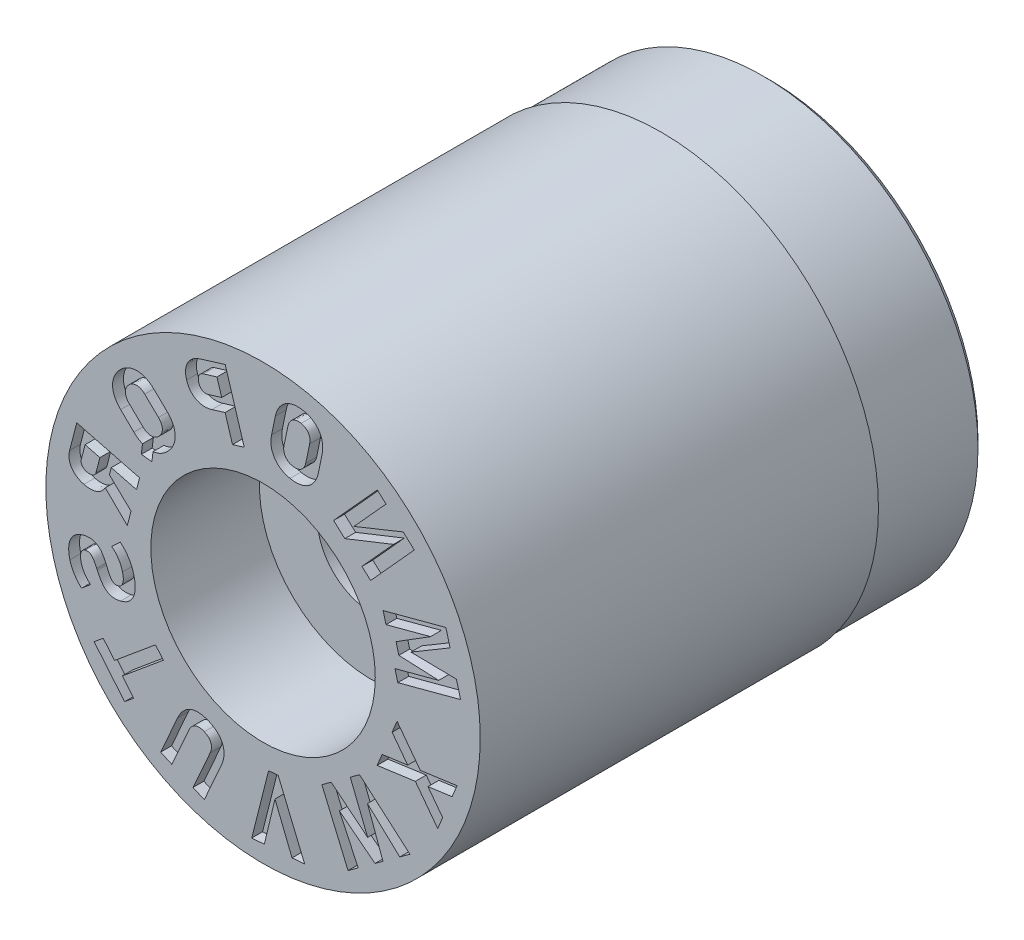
from build123d import *

# Parameters (mm, degrees)
SKETCH4_W          = 3
SKETCH4_H          = 1
CUT_EXTRUDE1_DEPTH = 0.3


with BuildPart() as part:
    # Sketch1 → Revolve1 (revolve)
    with BuildSketch(Plane(origin=(0, 0, 0), x_dir=(0, 0, -1), z_dir=(1, 0, 0)), mode=Mode.PRIVATE) as revolve1_sk:
        Polygon((0, 6), (0, 3.1), (3, 3.1), (3, 1.5), (14, 1.5), (14, 5.75), (13.75, 6), align=None)
    revolve(revolve1_sk.sketch.rotate(Axis((0, 0, 3.797909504), (0, 0, -1)), 90), axis=Axis((0, 0, 3.797909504), (0, 0, -1)))

    # Sketch4 → Cut-Revolve1 (revolve, cut)
    with BuildSketch(Plane(origin=(0, 0, 0), x_dir=(0, 0, -1), z_dir=(1, 0, 0)), mode=Mode.PRIVATE) as cut_revolve1_sk:
        with Locations((12.5, 6.435)):
            Rectangle(SKETCH4_W, SKETCH4_H)
    revolve(cut_revolve1_sk.sketch.rotate(Axis((0, 0, 0), (0, 0, -1)), 90), axis=Axis((0, 0, 0), (0, 0, -1)), mode=Mode.SUBTRACT)

    # Sketch5 → Cut-Extrude1 (cut)
    # profile 1 of 12: a face of its own
    with BuildSketch(Plane.XY):
        Polygon((5.165432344, 1.744404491), (5.050616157, 2.174785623), (3.316452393, 1.712478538), (3.395817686, 1.41575396), (4.627323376, 1.744008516), (3.674151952, 1.147631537), (3.751081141, 0.858816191), (4.851491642, 0.809771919), (3.643040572, 0.487662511), (3.722087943, 0.190754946), (5.456251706, 0.653062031), (5.341753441, 1.083626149), (4.084829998, 1.102548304), align=None)
    # profile 2 of 12: a face of its own
    with BuildSketch(Plane.XY):
        with BuildLine():
            Line((-1.044555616, 5.41745806), (-1.368184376, 5.318713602))
            Line((-1.368184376, 5.318713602), (-1.733205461, 5.207305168))
            add(Edge.make_bspline(
                [(-1.733205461, 5.207305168), (-1.784002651, 5.192190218), (-1.856286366, 5.161722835), (-1.941617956, 5.105150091), (-1.99654212, 5.057090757), (-2.043649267, 5.003344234), (-2.081646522, 4.944277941), (-2.111088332, 4.880652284), (-2.13062999, 4.812701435), (-2.141422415, 4.741543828), (-2.142364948, 4.641165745), (-2.1268093, 4.565880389), (-2.112011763, 4.516342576)],
                knots=[0, 0, 0, 0, 0.179249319, 0.263207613, 0.345336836, 0.425393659, 0.504137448, 0.582089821, 0.661679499, 0.74247115, 0.824840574, 1, 1, 1, 1], degree=3))
            add(Edge.make_bspline(
                [(-2.112011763, 4.516342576), (-2.09694524, 4.466650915), (-2.066944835, 4.395785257), (-2.010203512, 4.312864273), (-1.96154023, 4.259985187), (-1.907399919, 4.21470733), (-1.847665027, 4.178589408), (-1.783117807, 4.151307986), (-1.714213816, 4.133340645), (-1.641861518, 4.124270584), (-1.539595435, 4.125316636), (-1.462748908, 4.140924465), (-1.412087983, 4.156402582)],
                knots=[0, 0, 0, 0, 0.175848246, 0.258224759, 0.339010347, 0.418385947, 0.496356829, 0.574427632, 0.654798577, 0.736649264, 0.820571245, 1, 1, 1, 1], degree=3))
            Line((-1.412087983, 4.156402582), (-1.047206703, 4.267768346))
            Line((-1.047206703, 4.267768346), (-0.843867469, 3.601994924))
            Line((-0.843867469, 3.601994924), (-0.520214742, 3.700660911))
            Line((-0.520214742, 3.700660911), (-1.044555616, 5.41745806))
        make_face()
        with BuildLine():
            Line((-1.142425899, 4.579535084), (-1.515667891, 4.465685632))
            add(Edge.make_bspline(
                [(-1.515667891, 4.465685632), (-1.53399933, 4.460377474), (-1.561893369, 4.45454321), (-1.599188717, 4.455670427), (-1.625855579, 4.460351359), (-1.651442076, 4.468646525), (-1.67525097, 4.480999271), (-1.697618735, 4.496163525), (-1.718161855, 4.514939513), (-1.736775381, 4.536705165), (-1.758926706, 4.5702991), (-1.769899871, 4.599081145), (-1.776270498, 4.618731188)],
                knots=[0, 0, 0, 0, 0.169095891, 0.248836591, 0.328291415, 0.407591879, 0.485444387, 0.564479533, 0.645699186, 0.730517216, 0.816943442, 1, 1, 1, 1], degree=3))
            add(Edge.make_bspline(
                [(-1.776270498, 4.618731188), (-1.782139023, 4.638805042), (-1.78905274, 4.66916884), (-1.789735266, 4.709709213), (-1.786773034, 4.738309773), (-1.780946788, 4.765550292), (-1.771042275, 4.790895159), (-1.758210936, 4.814470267), (-1.741317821, 4.835295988), (-1.72209954, 4.854328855), (-1.691304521, 4.876095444), (-1.664676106, 4.887225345), (-1.646184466, 4.893056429)],
                knots=[0, 0, 0, 0, 0.184004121, 0.270929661, 0.354752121, 0.43598557, 0.514588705, 0.592824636, 0.670550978, 0.749073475, 0.829594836, 1, 1, 1, 1], degree=3))
            Line((-1.646184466, 4.893056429), (-1.272951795, 5.006903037))
            Line((-1.272951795, 5.006903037), (-1.142425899, 4.579535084))
        make_face(mode=Mode.SUBTRACT)
    # profile 3 of 12: a face of its own
    with BuildSketch(Plane.XY):
        Polygon((4.178673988, 3.59236831), (3.871348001, 3.870865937), (2.512445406, 3.323196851), (3.396866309, 4.30017916), (3.156380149, 4.517832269), (1.949458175, 3.184602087), (2.258753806, 2.904824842), (3.602273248, 3.438584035), (2.731630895, 2.476827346), (2.971752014, 2.259138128), align=None)
    # profile 4 of 12: a face of its own
    with BuildSketch(Plane.XY):
        with BuildLine():
            Line((1.526209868, 4.105294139), (1.630966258, 4.605963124))
            add(Edge.make_bspline(
                [(1.630966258, 4.605963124), (1.637182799, 4.637462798), (1.645233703, 4.684487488), (1.649233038, 4.747184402), (1.649472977, 4.79260781), (1.647390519, 4.837170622), (1.641854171, 4.880599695), (1.634055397, 4.923267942), (1.622940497, 4.964748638), (1.609423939, 5.005046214), (1.593466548, 5.043856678), (1.574772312, 5.080966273), (1.55332772, 5.116170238), (1.529887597, 5.149989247), (1.503507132, 5.181817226), (1.475044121, 5.212435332), (1.443687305, 5.240774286), (1.410394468, 5.267372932), (1.375095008, 5.292096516), (1.337634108, 5.31445034), (1.298184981, 5.334354), (1.257031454, 5.352450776), (1.19863319, 5.373558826), (1.152929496, 5.385429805), (1.121762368, 5.39182062)],
                knots=[0, 0, 0, 0, 0.091336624, 0.135318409, 0.178449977, 0.220421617, 0.262031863, 0.302813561, 0.343636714, 0.383994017, 0.423572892, 0.462826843, 0.501982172, 0.540671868, 0.579691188, 0.619399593, 0.65941112, 0.699714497, 0.740479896, 0.78182652, 0.82360918, 0.866016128, 0.909554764, 1, 1, 1, 1], degree=3))
            add(Edge.make_bspline(
                [(1.121762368, 5.39182062), (1.090707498, 5.398710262), (1.044133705, 5.405327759), (0.982218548, 5.409781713), (0.937378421, 5.409828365), (0.893285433, 5.407312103), (0.850200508, 5.401835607), (0.807897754, 5.393348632), (0.766667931, 5.382188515), (0.726594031, 5.368548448), (0.688163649, 5.352080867), (0.651445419, 5.333071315), (0.615863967, 5.312270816), (0.58265524, 5.287686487), (0.550545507, 5.261350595), (0.520166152, 5.232357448), (0.491752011, 5.200841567), (0.464907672, 5.167301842), (0.440550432, 5.131341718), (0.418020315, 5.093749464), (0.397866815, 5.054005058), (0.380044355, 5.012314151), (0.359254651, 4.953034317), (0.346728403, 4.907022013), (0.340381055, 4.875455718)],
                knots=[0, 0, 0, 0, 0.090357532, 0.133573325, 0.17639157, 0.217748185, 0.259065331, 0.299763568, 0.340320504, 0.380426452, 0.420022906, 0.459061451, 0.497938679, 0.537051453, 0.576386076, 0.615964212, 0.656310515, 0.696955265, 0.738000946, 0.77969807, 0.821486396, 0.864595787, 0.908510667, 1, 1, 1, 1], degree=3))
            Line((0.340381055, 4.875455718), (0.235624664, 4.374786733))
            add(Edge.make_bspline(
                [(0.235624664, 4.374786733), (0.229424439, 4.34328828), (0.221326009, 4.296260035), (0.217402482, 4.23356879), (0.216955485, 4.188074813), (0.219790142, 4.143574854), (0.224503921, 4.099984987), (0.232996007, 4.057424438), (0.243971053, 4.015857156), (0.25739951, 3.975603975), (0.273705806, 3.93702713), (0.292323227, 3.900109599), (0.313371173, 3.864639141), (0.337350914, 3.831141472), (0.363125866, 3.798664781), (0.392299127, 3.768645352), (0.423089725, 3.739730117), (0.456565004, 3.713263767), (0.491822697, 3.688496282), (0.529192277, 3.666221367), (0.568623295, 3.646285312), (0.609668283, 3.628241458), (0.668054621, 3.607158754), (0.713639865, 3.595420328), (0.744681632, 3.588593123)],
                knots=[0, 0, 0, 0, 0.09136596, 0.135361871, 0.178507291, 0.220649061, 0.262096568, 0.303087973, 0.343924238, 0.384294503, 0.423645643, 0.4629122, 0.501796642, 0.540795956, 0.579987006, 0.619572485, 0.65970998, 0.700026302, 0.740804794, 0.782164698, 0.823613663, 0.866381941, 0.909587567, 1, 1, 1, 1], degree=3))
            add(Edge.make_bspline(
                [(0.744681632, 3.588593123), (0.775861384, 3.582580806), (0.822435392, 3.574739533), (0.884450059, 3.570865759), (0.929427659, 3.571013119), (0.973537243, 3.573213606), (1.016725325, 3.578784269), (1.059030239, 3.587248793), (1.10025649, 3.598419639), (1.140342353, 3.612039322), (1.178729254, 3.62857651), (1.215633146, 3.647345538), (1.25060991, 3.669085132), (1.284439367, 3.69274841), (1.31634557, 3.719304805), (1.346768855, 3.748232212), (1.375180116, 3.77976069), (1.40199059, 3.813317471), (1.426480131, 3.849183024), (1.448527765, 3.887184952), (1.468793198, 3.92684404), (1.486582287, 3.968554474), (1.507339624, 4.027713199), (1.519860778, 4.07372906), (1.526209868, 4.105294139)],
                knots=[0, 0, 0, 0, 0.090308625, 0.133954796, 0.176439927, 0.218092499, 0.259395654, 0.300080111, 0.340623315, 0.380715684, 0.42029873, 0.459324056, 0.498271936, 0.537250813, 0.576572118, 0.616136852, 0.656469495, 0.697100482, 0.738132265, 0.779773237, 0.821894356, 0.864641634, 0.908541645, 1, 1, 1, 1], degree=3))
        make_face()
        with BuildLine():
            Line((0.579153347, 4.294282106), (0.687307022, 4.811881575))
            add(Edge.make_bspline(
                [(0.687307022, 4.811881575), (0.69403254, 4.840761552), (0.705780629, 4.883493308), (0.733761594, 4.933814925), (0.757305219, 4.967357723), (0.784946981, 4.996348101), (0.815600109, 5.020741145), (0.849441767, 5.04029762), (0.886191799, 5.054475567), (0.925236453, 5.064022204), (0.981129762, 5.069159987), (1.02384609, 5.064769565), (1.052218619, 5.058713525)],
                knots=[0, 0, 0, 0, 0.179938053, 0.264468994, 0.346756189, 0.426903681, 0.505549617, 0.582668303, 0.662059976, 0.742723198, 0.824728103, 1, 1, 1, 1], degree=3))
            add(Edge.make_bspline(
                [(1.052218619, 5.058713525), (1.080665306, 5.052940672), (1.121789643, 5.040110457), (1.170915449, 5.012755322), (1.202735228, 4.988314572), (1.230537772, 4.96056308), (1.25387289, 4.929371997), (1.272060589, 4.894600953), (1.285759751, 4.856925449), (1.294037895, 4.816758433), (1.298892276, 4.75938674), (1.293748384, 4.715526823), (1.287773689, 4.686320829)],
                knots=[0, 0, 0, 0, 0.175431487, 0.25780614, 0.338407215, 0.416986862, 0.49438821, 0.572700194, 0.653145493, 0.735731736, 0.819660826, 1, 1, 1, 1], degree=3))
            Line((1.287773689, 4.686320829), (1.179620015, 4.168721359))
            add(Edge.make_bspline(
                [(1.179620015, 4.168721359), (1.173426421, 4.139615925), (1.160347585, 4.097490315), (1.133301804, 4.04670384), (1.109571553, 4.013282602), (1.082116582, 3.984259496), (1.051230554, 3.960180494), (1.017668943, 3.940384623), (0.981009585, 3.925903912), (0.941921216, 3.916364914), (0.885855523, 3.911634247), (0.843018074, 3.915578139), (0.814561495, 3.921553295)],
                knots=[0, 0, 0, 0, 0.179868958, 0.264322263, 0.346593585, 0.426725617, 0.504705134, 0.582404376, 0.661260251, 0.741907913, 0.824543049, 1, 1, 1, 1], degree=3))
            add(Edge.make_bspline(
                [(0.814561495, 3.921553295), (0.786273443, 3.927757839), (0.745149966, 3.940332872), (0.696371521, 3.967885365), (0.664105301, 3.99176833), (0.636562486, 4.019995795), (0.613033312, 4.051208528), (0.594872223, 4.086008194), (0.581165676, 4.123675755), (0.572889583, 4.163844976), (0.568034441, 4.221215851), (0.573178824, 4.265076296), (0.579153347, 4.294282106)],
                knots=[0, 0, 0, 0, 0.175336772, 0.25698086, 0.337413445, 0.416956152, 0.494361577, 0.572677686, 0.653127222, 0.735717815, 0.819651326, 1, 1, 1, 1], degree=3))
        make_face(mode=Mode.SUBTRACT)
    # profile 5 of 12: a face of its own
    with BuildSketch(Plane.XY):
        with BuildLine():
            Line((-4.192520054, 1.377942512), (-3.49497097, 1.197041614))
            Line((-3.49497097, 1.197041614), (-3.410465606, 1.524131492))
            Line((-3.410465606, 1.524131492), (-5.14567057, 1.974135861))
            Line((-5.14567057, 1.974135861), (-5.34241688, 1.214464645))
            add(Edge.make_bspline(
                [(-5.34241688, 1.214464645), (-5.354279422, 1.169291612), (-5.364170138, 1.100723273), (-5.358865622, 1.010161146), (-5.345209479, 0.946246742), (-5.322875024, 0.885568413), (-5.292042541, 0.828941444), (-5.252998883, 0.776721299), (-5.205737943, 0.729546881), (-5.151370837, 0.687362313), (-5.067156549, 0.638628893), (-4.997115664, 0.612771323), (-4.948000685, 0.600624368)],
                knots=[0, 0, 0, 0, 0.170567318, 0.250705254, 0.330137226, 0.408355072, 0.486026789, 0.564778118, 0.645617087, 0.729164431, 0.815361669, 1, 1, 1, 1], degree=3))
            add(Edge.make_bspline(
                [(-4.948000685, 0.600624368), (-4.899271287, 0.588029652), (-4.825746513, 0.575325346), (-4.72870142, 0.57779281), (-4.660613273, 0.587714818), (-4.596406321, 0.606073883), (-4.536786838, 0.632778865), (-4.482189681, 0.667531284), (-4.433328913, 0.710305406), (-4.390987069, 0.75852104), (-4.367764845, 0.794143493), (-4.357609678, 0.812124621)],
                knots=[0, 0, 0, 0, 0.184091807, 0.27017674, 0.353602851, 0.434756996, 0.513264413, 0.591388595, 0.670212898, 0.749653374, 0.825010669, 0.825010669, 0.825010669, 0.825010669], degree=3))
            Line((-4.357609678, 0.812124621), (-3.75045196, 0.212247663))
            Line((-3.75045196, 0.212247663), (-3.647743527, 0.608145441))
            Line((-3.647743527, 0.608145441), (-4.243895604, 1.17986317))
            Line((-4.243895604, 1.17986317), (-4.192520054, 1.377942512))
        make_face()
        with BuildLine():
            Line((-4.507443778, 1.459614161), (-4.613012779, 1.053072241))
            add(Edge.make_bspline(
                [(-4.613012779, 1.053072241), (-4.617355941, 1.037444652), (-4.625541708, 1.014250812), (-4.644304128, 0.988255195), (-4.660559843, 0.971316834), (-4.679099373, 0.956785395), (-4.700055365, 0.945300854), (-4.722945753, 0.936184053), (-4.747946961, 0.930702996), (-4.774500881, 0.927790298), (-4.812565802, 0.92766733), (-4.841424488, 0.932779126), (-4.860773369, 0.937116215)],
                knots=[0, 0, 0, 0, 0.159482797, 0.236468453, 0.311877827, 0.388500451, 0.4658197, 0.544821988, 0.628636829, 0.715237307, 0.805713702, 1, 1, 1, 1], degree=3))
            add(Edge.make_bspline(
                [(-4.860773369, 0.937116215), (-4.880151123, 0.941690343), (-4.90753206, 0.951688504), (-4.941149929, 0.969405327), (-4.96264354, 0.98506171), (-4.982078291, 1.001699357), (-4.99759072, 1.020746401), (-5.01047161, 1.040959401), (-5.019396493, 1.062835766), (-5.025616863, 1.085644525), (-5.028061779, 1.118138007), (-5.025496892, 1.14284402), (-5.020912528, 1.159112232)],
                knots=[0, 0, 0, 0, 0.193389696, 0.282661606, 0.368882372, 0.451760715, 0.530887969, 0.607069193, 0.684211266, 0.759972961, 0.836228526, 1, 1, 1, 1], degree=3))
            Line((-5.020912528, 1.159112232), (-4.915405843, 1.565414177))
            Line((-4.915405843, 1.565414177), (-4.507443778, 1.459614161))
        make_face(mode=Mode.SUBTRACT)
    # profile 6 of 12: a face of its own
    with BuildSketch(Plane.XY):
        Polygon((-4.102731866, -3.191688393), (-4.415680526, -2.815288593), (-4.666510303, -3.023736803), (-3.823806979, -4.037300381), (-3.572977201, -3.828852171), (-3.886058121, -3.452293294), (-2.754439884, -2.511320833), (-2.971144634, -2.250741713), align=None)
    # profile 7 of 12: a face of its own
    with BuildSketch(Plane.XY):
        with BuildLine():
            Line((-3.329749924, 2.379707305), (-3.362491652, 2.110075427))
            Line((-3.362491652, 2.110075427), (-3.070416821, 2.079452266))
            Line((-3.070416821, 2.079452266), (-3.039359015, 2.336379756))
            add(Edge.make_bspline(
                [(-3.039359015, 2.336379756), (-3.030067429, 2.337375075), (-3.007028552, 2.34051761), (-2.970399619, 2.348247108), (-2.929378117, 2.358970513), (-2.888829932, 2.372733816), (-2.849135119, 2.389715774), (-2.8101777, 2.409171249), (-2.772363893, 2.432131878), (-2.734787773, 2.456910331), (-2.686261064, 2.495805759), (-2.651036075, 2.52717523), (-2.629188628, 2.550395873)],
                knots=[0.553403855, 0.553403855, 0.553403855, 0.553403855, 0.579915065, 0.619336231, 0.659573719, 0.70019099, 0.740726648, 0.782026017, 0.823652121, 0.866210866, 0.909660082, 1, 1, 1, 1], degree=3))
            add(Edge.make_bspline(
                [(-2.629188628, 2.550395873), (-2.606992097, 2.573257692), (-2.576220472, 2.608989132), (-2.539333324, 2.658924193), (-2.515183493, 2.696874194), (-2.494197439, 2.735855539), (-2.475546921, 2.775342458), (-2.459989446, 2.815607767), (-2.44732303, 2.856491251), (-2.43787414, 2.897690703), (-2.43084764, 2.938943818), (-2.427777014, 2.980203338), (-2.42663541, 3.021541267), (-2.429283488, 3.062805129), (-2.434715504, 3.104068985), (-2.443082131, 3.145239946), (-2.45436016, 3.186315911), (-2.468544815, 3.226940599), (-2.485712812, 3.266832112), (-2.505800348, 3.305878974), (-2.528777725, 3.344104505), (-2.554735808, 3.381344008), (-2.593202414, 3.431013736), (-2.625978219, 3.465764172), (-2.649116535, 3.488219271)],
                knots=[0, 0, 0, 0, 0.090426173, 0.133688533, 0.176148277, 0.218000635, 0.259295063, 0.300043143, 0.340440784, 0.380689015, 0.419969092, 0.459107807, 0.498041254, 0.537279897, 0.576344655, 0.616120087, 0.656449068, 0.697180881, 0.73817807, 0.779637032, 0.821747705, 0.86469138, 0.908434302, 1, 1, 1, 1], degree=3))
            Line((-2.649116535, 3.488219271), (-3.016657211, 3.844445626))
            add(Edge.make_bspline(
                [(-3.016657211, 3.844445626), (-3.039455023, 3.867227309), (-3.075872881, 3.898186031), (-3.126748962, 3.935209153), (-3.164838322, 3.96018276), (-3.204024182, 3.981559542), (-3.243514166, 4.000576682), (-3.283884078, 4.016598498), (-3.324954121, 4.029442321), (-3.366369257, 4.039459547), (-3.407806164, 4.046509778), (-3.44926284, 4.050860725), (-3.490641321, 4.05135965), (-3.531931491, 4.04993415), (-3.573077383, 4.044647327), (-3.614155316, 4.036768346), (-3.654980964, 4.025778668), (-3.69543798, 4.012012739), (-3.734983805, 3.994833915), (-3.773939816, 3.975066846), (-3.811889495, 3.952537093), (-3.849230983, 3.927394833), (-3.897761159, 3.888693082), (-3.932933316, 3.857242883), (-3.954798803, 3.834049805)],
                knots=[0, 0, 0, 0, 0.091402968, 0.135416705, 0.178547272, 0.22056748, 0.262011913, 0.302888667, 0.343719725, 0.384050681, 0.423731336, 0.462947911, 0.502219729, 0.541090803, 0.580114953, 0.619825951, 0.659729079, 0.700018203, 0.741006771, 0.781995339, 0.823929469, 0.866198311, 0.909651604, 1, 1, 1, 1], degree=3))
            add(Edge.make_bspline(
                [(-3.954798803, 3.834049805), (-3.977024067, 3.811205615), (-4.007711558, 3.775422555), (-4.044793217, 3.725488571), (-4.068563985, 3.68731025), (-4.089911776, 3.648538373), (-4.108422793, 3.609092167), (-4.123993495, 3.568839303), (-4.136699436, 3.527959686), (-4.145984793, 3.486709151), (-4.153634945, 3.445534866), (-4.156542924, 3.404104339), (-4.157761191, 3.362764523), (-4.154890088, 3.321541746), (-4.150262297, 3.280276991), (-4.1411078, 3.239245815), (-4.130041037, 3.19810817), (-4.115792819, 3.157497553), (-4.098659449, 3.117591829), (-4.07844728, 3.078493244), (-4.055680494, 3.040017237), (-4.029590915, 3.002731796), (-3.991150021, 2.95304676), (-3.958358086, 2.918305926), (-3.935225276, 2.895847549)],
                knots=[0, 0, 0, 0, 0.090391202, 0.133636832, 0.176367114, 0.217904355, 0.259182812, 0.299915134, 0.340297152, 0.380529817, 0.419863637, 0.458987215, 0.498252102, 0.537128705, 0.576145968, 0.615965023, 0.656278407, 0.696994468, 0.737975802, 0.779418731, 0.821816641, 0.864743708, 0.908469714, 1, 1, 1, 1], degree=3))
            Line((-3.935225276, 2.895847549), (-3.5676846, 2.539621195))
            add(Edge.make_bspline(
                [(-3.5676846, 2.539621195), (-3.544869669, 2.516865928), (-3.508501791, 2.48583008), (-3.457627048, 2.448988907), (-3.419754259, 2.423672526), (-3.380470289, 2.402545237), (-3.35028581, 2.388392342), (-3.333327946, 2.381191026), (-3.329749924, 2.379707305)],
                knots=[0, 0, 0, 0, 0.091394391, 0.135403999, 0.178246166, 0.220560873, 0.261842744, 0.272833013, 0.272833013, 0.272833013, 0.272833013], degree=3))
        make_face()
        with BuildLine():
            Line((-3.315376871, 2.78771233), (-3.695798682, 3.155987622))
            add(Edge.make_bspline(
                [(-3.695798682, 3.155987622), (-3.717082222, 3.176996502), (-3.745861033, 3.210532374), (-3.774603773, 3.260592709), (-3.789637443, 3.298734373), (-3.800049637, 3.337285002), (-3.804331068, 3.376250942), (-3.802673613, 3.415297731), (-3.794918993, 3.454000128), (-3.782362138, 3.492284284), (-3.756531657, 3.542265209), (-3.729908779, 3.576094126), (-3.709788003, 3.597054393)],
                knots=[0, 0, 0, 0, 0.180529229, 0.264652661, 0.347008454, 0.427165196, 0.50483005, 0.582494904, 0.661932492, 0.74221129, 0.824735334, 1, 1, 1, 1], degree=3))
            add(Edge.make_bspline(
                [(-3.709788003, 3.597054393), (-3.689924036, 3.618298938), (-3.656560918, 3.645212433), (-3.607514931, 3.672585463), (-3.569815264, 3.686493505), (-3.531367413, 3.695413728), (-3.492361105, 3.698033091), (-3.453182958, 3.69540876), (-3.414123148, 3.686587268), (-3.375750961, 3.672247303), (-3.324416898, 3.645929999), (-3.290191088, 3.617700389), (-3.268622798, 3.597099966)],
                knots=[0, 0, 0, 0, 0.175091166, 0.256927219, 0.337893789, 0.416762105, 0.494293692, 0.572926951, 0.652922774, 0.734997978, 0.819565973, 1, 1, 1, 1], degree=3))
            Line((-3.268622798, 3.597099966), (-2.888200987, 3.228824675))
            add(Edge.make_bspline(
                [(-2.888200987, 3.228824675), (-2.86677548, 3.208083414), (-2.838084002, 3.174564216), (-2.809449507, 3.124577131), (-2.794183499, 3.086396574), (-2.784453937, 3.047452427), (-2.779960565, 3.00830772), (-2.781807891, 2.969182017), (-2.788952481, 2.930402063), (-2.801627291, 2.892144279), (-2.827598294, 2.84236607), (-2.853086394, 2.807817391), (-2.873832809, 2.787403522)],
                knots=[0, 0, 0, 0, 0.179935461, 0.26404173, 0.34638072, 0.42708227, 0.505466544, 0.583115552, 0.662375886, 0.742638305, 0.825145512, 1, 1, 1, 1], degree=3))
            add(Edge.make_bspline(
                [(-2.873832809, 2.787403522), (-2.893964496, 2.766282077), (-2.92704716, 2.738667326), (-2.976581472, 2.711948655), (-3.01415773, 2.697913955), (-3.052741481, 2.689051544), (-3.091770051, 2.686262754), (-3.130922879, 2.689546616), (-3.169948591, 2.69830379), (-3.208578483, 2.712280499), (-3.25927318, 2.739775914), (-3.294100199, 2.766751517), (-3.315376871, 2.78771233)],
                knots=[0, 0, 0, 0, 0.175985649, 0.257432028, 0.338339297, 0.417149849, 0.495361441, 0.573284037, 0.65322127, 0.735919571, 0.820148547, 1, 1, 1, 1], degree=3))
        make_face(mode=Mode.SUBTRACT)
    # profile 8 of 12: a face of its own
    with BuildSketch(Plane.XY):
        with BuildLine():
            Line((-3.947487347, -0.281314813), (-4.181714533, -0.50182307))
            add(Edge.make_bspline(
                [(-4.181714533, -0.50182307), (-4.145326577, -0.528699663), (-4.094671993, -0.574981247), (-4.035154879, -0.645290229), (-3.994647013, -0.703303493), (-3.958205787, -0.764618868), (-3.916365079, -0.850303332), (-3.894043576, -0.918387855), (-3.882133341, -0.964465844)],
                knots=[0, 0, 0, 0, 0.241379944, 0.364999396, 0.491374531, 0.618868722, 0.74565667, 1, 1, 1, 1], degree=3))
            add(Edge.make_bspline(
                [(-3.882133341, -0.964465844), (-3.875957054, -0.989866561), (-3.867918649, -1.027175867), (-3.862084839, -1.076306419), (-3.859366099, -1.110160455), (-3.860158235, -1.142363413), (-3.862406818, -1.172684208), (-3.867346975, -1.201239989), (-3.874314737, -1.227793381), (-3.883346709, -1.252417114), (-3.8946896, -1.274640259), (-3.90817686, -1.294460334), (-3.9235832, -1.312071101), (-3.941480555, -1.326931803), (-3.968656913, -1.343523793), (-3.991296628, -1.352059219), (-4.007049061, -1.35618213)],
                knots=[0, 0, 0, 0, 0.170586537, 0.248328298, 0.322568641, 0.391806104, 0.458159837, 0.52068033, 0.580487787, 0.636971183, 0.691384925, 0.742745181, 0.792953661, 0.843465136, 0.893800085, 1, 1, 1, 1], degree=3))
            Line((-4.007049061, -1.35618213), (-4.008516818, -1.356547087))
            add(Edge.make_bspline(
                [(-4.008516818, -1.356547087), (-4.029590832, -1.362214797), (-4.061585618, -1.365039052), (-4.102537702, -1.357268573), (-4.129434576, -1.344869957), (-4.153831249, -1.327798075), (-4.176396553, -1.307230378), (-4.197091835, -1.283074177), (-4.216064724, -1.255125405), (-4.233583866, -1.222645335), (-4.259761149, -1.171410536), (-4.278215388, -1.129857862), (-4.290774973, -1.100728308)],
                knots=[0, 0, 0, 0, 0.155113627, 0.225021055, 0.294520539, 0.364237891, 0.436402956, 0.511396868, 0.590249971, 0.67647546, 0.774019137, 1, 1, 1, 1], degree=3))
            add(Edge.make_bspline(
                [(-4.290774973, -1.100728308), (-4.291664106, -1.098566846), (-4.293447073, -1.094259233), (-4.295029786, -1.08985763), (-4.296347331, -1.087903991)],
                knots=[0, 0, 0, 0, 0.500653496, 1, 1, 1, 1], degree=3))
            Line((-4.296347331, -1.087903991), (-4.306499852, -1.062558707))
            add(Edge.make_bspline(
                [(-4.306499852, -1.062558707), (-4.328281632, -1.01073179), (-4.362369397, -0.937423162), (-4.41123024, -0.846725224), (-4.446815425, -0.789187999), (-4.485438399, -0.738010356), (-4.531455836, -0.694645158), (-4.584114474, -0.657541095), (-4.632890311, -0.632134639), (-4.675353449, -0.615991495), (-4.709852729, -0.607347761), (-4.74625372, -0.601206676), (-4.784794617, -0.598944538), (-4.825377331, -0.59961466), (-4.883897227, -0.605398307), (-4.928471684, -0.613897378), (-4.958517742, -0.621542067)],
                knots=[0, 0, 0, 0, 0.19047014, 0.273752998, 0.348938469, 0.419574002, 0.490324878, 0.562217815, 0.63726617, 0.67600916, 0.715891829, 0.757573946, 0.800921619, 0.846504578, 0.89498026, 1, 1, 1, 1], degree=3))
            Line((-4.958517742, -0.621542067), (-4.959985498, -0.621907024))
            add(Edge.make_bspline(
                [(-4.959985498, -0.621907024), (-4.987330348, -0.628528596), (-5.026950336, -0.641180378), (-5.077225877, -0.662217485), (-5.11232539, -0.679477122), (-5.145260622, -0.699054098), (-5.176003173, -0.720858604), (-5.204706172, -0.744434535), (-5.231343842, -0.769730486), (-5.255444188, -0.797196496), (-5.277245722, -0.82641676), (-5.297507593, -0.856764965), (-5.314231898, -0.889537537), (-5.329453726, -0.923535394), (-5.341914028, -0.959541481), (-5.352359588, -0.997036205), (-5.36024953, -1.036232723), (-5.365398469, -1.076968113), (-5.369038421, -1.119088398), (-5.369385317, -1.162742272), (-5.367403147, -1.207764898), (-5.363077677, -1.254146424), (-5.354076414, -1.318973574), (-5.343704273, -1.367857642), (-5.335631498, -1.400777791)],
                knots=[0, 0, 0, 0, 0.086007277, 0.126939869, 0.166595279, 0.205531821, 0.243984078, 0.281753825, 0.319046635, 0.356206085, 0.393346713, 0.430504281, 0.467637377, 0.50571687, 0.544355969, 0.584034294, 0.624685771, 0.666505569, 0.709556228, 0.753906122, 0.799904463, 0.847339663, 0.896318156, 1, 1, 1, 1], degree=3))
            add(Edge.make_bspline(
                [(-5.335631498, -1.400777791), (-5.327223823, -1.432396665), (-5.313231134, -1.479965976), (-5.287788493, -1.541426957), (-5.259501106, -1.60368366), (-5.21634247, -1.678819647), (-5.137342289, -1.794071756), (-5.064920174, -1.870907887), (-5.012383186, -1.917308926)],
                knots=[0, 0, 0, 0, 0.158911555, 0.240043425, 0.322665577, 0.490655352, 0.659731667, 1, 1, 1, 1], degree=3))
            Line((-5.012383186, -1.917308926), (-4.768028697, -1.708034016))
            add(Edge.make_bspline(
                [(-4.768028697, -1.708034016), (-4.798937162, -1.680456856), (-4.843163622, -1.637094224), (-4.894692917, -1.573408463), (-4.929503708, -1.52449233), (-4.959957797, -1.474580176), (-4.992979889, -1.408300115), (-5.011365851, -1.356926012), (-5.020063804, -1.322311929)],
                knots=[0, 0, 0, 0, 0.265982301, 0.396333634, 0.525300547, 0.651054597, 0.771158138, 1, 1, 1, 1], degree=3))
            add(Edge.make_bspline(
                [(-5.020063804, -1.322311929), (-5.025992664, -1.298442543), (-5.03362969, -1.263295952), (-5.039038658, -1.2170519), (-5.041945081, -1.185195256), (-5.041382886, -1.154974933), (-5.039729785, -1.126669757), (-5.035786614, -1.100015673), (-5.029602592, -1.075287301), (-5.021363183, -1.052415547), (-5.011008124, -1.031930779), (-4.998964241, -1.013555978), (-4.984645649, -0.997726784), (-4.968895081, -0.983623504), (-4.9441292, -0.968629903), (-4.923842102, -0.960282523), (-4.909250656, -0.957204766)],
                knots=[0, 0, 0, 0, 0.173025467, 0.252201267, 0.327257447, 0.397640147, 0.464424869, 0.526484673, 0.586732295, 0.643338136, 0.696995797, 0.747759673, 0.797256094, 0.84667035, 0.895784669, 1, 1, 1, 1], degree=3))
            Line((-4.909250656, -0.957204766), (-4.908106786, -0.95701202))
            add(Edge.make_bspline(
                [(-4.908106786, -0.95701202), (-4.88517438, -0.951752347), (-4.850326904, -0.946835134), (-4.805992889, -0.956004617), (-4.7770096, -0.969576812), (-4.751156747, -0.988011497), (-4.726597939, -1.008857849), (-4.705351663, -1.033909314), (-4.685613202, -1.062522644), (-4.666112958, -1.095875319), (-4.635953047, -1.151616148), (-4.614099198, -1.197467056), (-4.598509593, -1.229868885)],
                knots=[0, 0, 0, 0, 0.156350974, 0.226804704, 0.29587269, 0.365881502, 0.435857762, 0.507883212, 0.58183955, 0.665041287, 0.762671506, 1, 1, 1, 1], degree=3))
            add(Edge.make_bspline(
                [(-4.598509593, -1.229868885), (-4.596401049, -1.232566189), (-4.594914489, -1.239234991), (-4.591649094, -1.245201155), (-4.590009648, -1.248199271)],
                knots=[0, 0, 0, 0, 0.492002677, 1, 1, 1, 1], degree=3))
            add(Edge.make_bspline(
                [(-4.590009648, -1.248199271), (-4.588101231, -1.25271551), (-4.583452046, -1.261330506), (-4.578774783, -1.269931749), (-4.576880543, -1.274454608)],
                knots=[0, 0, 0, 0, 0.499992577, 1, 1, 1, 1], degree=3))
            add(Edge.make_bspline(
                [(-4.576880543, -1.274454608), (-4.554394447, -1.323213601), (-4.519144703, -1.392289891), (-4.467914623, -1.4771941), (-4.430705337, -1.53176264), (-4.390128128, -1.579695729), (-4.343616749, -1.620420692), (-4.291328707, -1.654529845), (-4.243566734, -1.67785293), (-4.202268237, -1.691960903), (-4.169007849, -1.699932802), (-4.134045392, -1.704796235), (-4.097225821, -1.707110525), (-4.058793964, -1.705919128), (-4.003708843, -1.700795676), (-3.962091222, -1.691913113), (-3.933822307, -1.685337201)],
                knots=[0, 0, 0, 0, 0.189358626, 0.273144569, 0.34957297, 0.422066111, 0.493982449, 0.566731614, 0.641676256, 0.680722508, 0.720434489, 0.762091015, 0.80505704, 0.850373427, 0.897539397, 1, 1, 1, 1], degree=3))
            Line((-3.933822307, -1.685337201), (-3.931706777, -1.684627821))
            add(Edge.make_bspline(
                [(-3.931706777, -1.684627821), (-3.90478123, -1.677949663), (-3.865377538, -1.666077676), (-3.815845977, -1.644566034), (-3.780993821, -1.627307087), (-3.749003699, -1.606887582), (-3.718346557, -1.585686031), (-3.690556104, -1.561365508), (-3.66428574, -1.535584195), (-3.64060331, -1.507552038), (-3.619243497, -1.477662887), (-3.599833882, -1.446299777), (-3.582803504, -1.413062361), (-3.568569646, -1.377841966), (-3.556909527, -1.340810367), (-3.546850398, -1.302111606), (-3.539406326, -1.261615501), (-3.534502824, -1.219495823), (-3.531708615, -1.175930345), (-3.53183035, -1.130960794), (-3.533217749, -1.084521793), (-3.538707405, -1.036848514), (-3.547888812, -0.97008366), (-3.558811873, -0.919751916), (-3.567061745, -0.885848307)],
                knots=[0, 0, 0, 0, 0.083718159, 0.123680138, 0.162773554, 0.200841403, 0.238025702, 0.275061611, 0.312040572, 0.348947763, 0.385557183, 0.42274331, 0.460080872, 0.498039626, 0.537153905, 0.577088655, 0.618551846, 0.661206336, 0.704906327, 0.750109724, 0.796782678, 0.84491987, 0.894727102, 1, 1, 1, 1], degree=3))
            add(Edge.make_bspline(
                [(-3.567061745, -0.885848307), (-3.577572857, -0.844559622), (-3.595593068, -0.783228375), (-3.627311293, -0.70447561), (-3.653131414, -0.646963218), (-3.681785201, -0.591610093), (-3.712792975, -0.538450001), (-3.746712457, -0.488113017), (-3.782859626, -0.440319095), (-3.821161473, -0.395650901), (-3.874044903, -0.340484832), (-3.917181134, -0.303451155), (-3.947487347, -0.281314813)],
                knots=[0, 0, 0, 0, 0.175644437, 0.262831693, 0.349668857, 0.43532723, 0.519542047, 0.603115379, 0.685284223, 0.766328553, 0.845432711, 1, 1, 1, 1], degree=3))
        make_face()
    # profile 9 of 12: a face of its own
    with BuildSketch(Plane.XY):
        with BuildLine():
            Line((-2.359885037, -3.693995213), (-2.828985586, -4.747009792))
            Line((-2.828985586, -4.747009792), (-2.518090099, -4.88568454))
            Line((-2.518090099, -4.88568454), (-2.045472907, -3.825062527))
            add(Edge.make_bspline(
                [(-2.045472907, -3.825062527), (-2.035976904, -3.802471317), (-2.018662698, -3.770918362), (-1.992012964, -3.732450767), (-1.970900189, -3.707441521), (-1.948319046, -3.68547876), (-1.924121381, -3.666829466), (-1.898712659, -3.650584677), (-1.871545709, -3.638240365), (-1.843350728, -3.628519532), (-1.814086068, -3.622773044), (-1.784029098, -3.619447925), (-1.753009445, -3.61982787), (-1.721184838, -3.623925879), (-1.676715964, -3.63446878), (-1.643543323, -3.645865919), (-1.621777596, -3.655897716)],
                knots=[0, 0, 0, 0, 0.141486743, 0.207518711, 0.270314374, 0.3304505, 0.389288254, 0.446711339, 0.504412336, 0.561416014, 0.618773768, 0.676474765, 0.736021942, 0.797680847, 0.861628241, 1, 1, 1, 1], degree=3))
            add(Edge.make_bspline(
                [(-1.621777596, -3.655897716), (-1.599666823, -3.665398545), (-1.568724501, -3.682398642), (-1.531113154, -3.708815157), (-1.506629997, -3.729748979), (-1.485525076, -3.752656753), (-1.467611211, -3.77716532), (-1.451991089, -3.802855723), (-1.440405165, -3.830472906), (-1.431292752, -3.859042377), (-1.425878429, -3.888750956), (-1.423992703, -3.919347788), (-1.424704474, -3.95071997), (-1.429272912, -3.983074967), (-1.439373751, -4.028704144), (-1.452266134, -4.062427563), (-1.462237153, -4.084801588)],
                knots=[0, 0, 0, 0, 0.138615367, 0.202930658, 0.264759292, 0.323988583, 0.382078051, 0.439599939, 0.49690103, 0.554319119, 0.612241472, 0.670493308, 0.73083678, 0.792858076, 0.858591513, 1, 1, 1, 1], degree=3))
            Line((-1.462237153, -4.084801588), (-1.934854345, -5.145423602))
            Line((-1.934854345, -5.145423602), (-1.623686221, -5.283852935))
            Line((-1.623686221, -5.283852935), (-1.154585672, -4.230838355))
            add(Edge.make_bspline(
                [(-1.154585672, -4.230838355), (-1.140959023, -4.199514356), (-1.121700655, -4.152847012), (-1.102930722, -4.089405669), (-1.09198524, -4.043488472), (-1.083479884, -3.998450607), (-1.078125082, -3.954118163), (-1.076610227, -3.910554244), (-1.077220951, -3.867794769), (-1.081389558, -3.826114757), (-1.088118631, -3.7853987), (-1.097537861, -3.745719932), (-1.110508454, -3.707375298), (-1.125992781, -3.670089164), (-1.144662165, -3.634193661), (-1.166106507, -3.599244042), (-1.190545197, -3.565632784), (-1.217766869, -3.533245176), (-1.24768248, -3.502102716), (-1.280660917, -3.472782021), (-1.31625146, -3.444834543), (-1.354433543, -3.418406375), (-1.40988094, -3.384493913), (-1.454072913, -3.361992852), (-1.484847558, -3.348546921)],
                knots=[0, 0, 0, 0, 0.09573397, 0.141070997, 0.185142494, 0.227879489, 0.269369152, 0.310049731, 0.349865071, 0.389039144, 0.427224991, 0.465375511, 0.503099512, 0.540461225, 0.578334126, 0.616281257, 0.655192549, 0.69459493, 0.73468175, 0.776012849, 0.818065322, 0.861338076, 0.905976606, 1, 1, 1, 1], degree=3))
            add(Edge.make_bspline(
                [(-1.484847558, -3.348546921), (-1.515579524, -3.335022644), (-1.561687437, -3.316771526), (-1.62401574, -3.298306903), (-1.669232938, -3.287572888), (-1.713735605, -3.279688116), (-1.757493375, -3.274985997), (-1.800461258, -3.273584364), (-1.842652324, -3.274856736), (-1.883838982, -3.279537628), (-1.924066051, -3.286828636), (-1.963256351, -3.296800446), (-2.001232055, -3.310318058), (-2.038175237, -3.326610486), (-2.073856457, -3.34605017), (-2.10857947, -3.368300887), (-2.141970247, -3.393524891), (-2.174239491, -3.421609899), (-2.20509536, -3.452358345), (-2.234557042, -3.485910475), (-2.262617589, -3.52209652), (-2.289495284, -3.560989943), (-2.323131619, -3.617907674), (-2.346391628, -3.662621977), (-2.359885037, -3.693995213)],
                knots=[0, 0, 0, 0, 0.094156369, 0.138778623, 0.182138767, 0.224380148, 0.265402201, 0.305403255, 0.344816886, 0.383629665, 0.421492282, 0.459362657, 0.496858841, 0.534365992, 0.572445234, 0.610653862, 0.649882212, 0.689651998, 0.730496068, 0.771910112, 0.814742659, 0.858808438, 0.904349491, 1, 1, 1, 1], degree=3))
        make_face()
    # profile 10 of 12: a face of its own
    with BuildSketch(Plane.XY):
        Polygon((-0.31343768, -5.544605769), (0.035790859, -5.518738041), (0.32980579, -4.289769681), (0.800726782, -5.462629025), (1.149955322, -5.436761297), (0.418668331, -3.680824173), (0.153386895, -3.700078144), align=None)
    # profile 11 of 12: a face of its own
    with BuildSketch(Plane.XY):
        Polygon((3.093034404, -4.449370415), (3.31243301, -4.289488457), (2.884741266, -3.119729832), (3.776325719, -3.951591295), (4.05765236, -3.746500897), (2.666710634, -2.539477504), (2.409207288, -2.726796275), (2.890016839, -3.927888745), (1.882351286, -3.110724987), (1.62519716, -3.298156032), (2.347815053, -4.992357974), (2.629141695, -4.787267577), (2.110397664, -3.683793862), align=None)
    # profile 12 of 12: a face of its own
    with BuildSketch(Plane.XY):
        Polygon((4.207561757, -1.927667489), (4.824938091, -2.749323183), (4.961917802, -2.41799435), (4.556454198, -1.87934365), (5.22241202, -1.787509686), (5.359650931, -1.455921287), (4.343744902, -1.596831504), (3.702207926, -0.741713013), (3.565487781, -1.073301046), (3.995207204, -1.645130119), (3.288680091, -1.742964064), (3.151700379, -2.074292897), align=None)
    extrude(amount=-CUT_EXTRUDE1_DEPTH, mode=Mode.SUBTRACT)


solid = part.part
